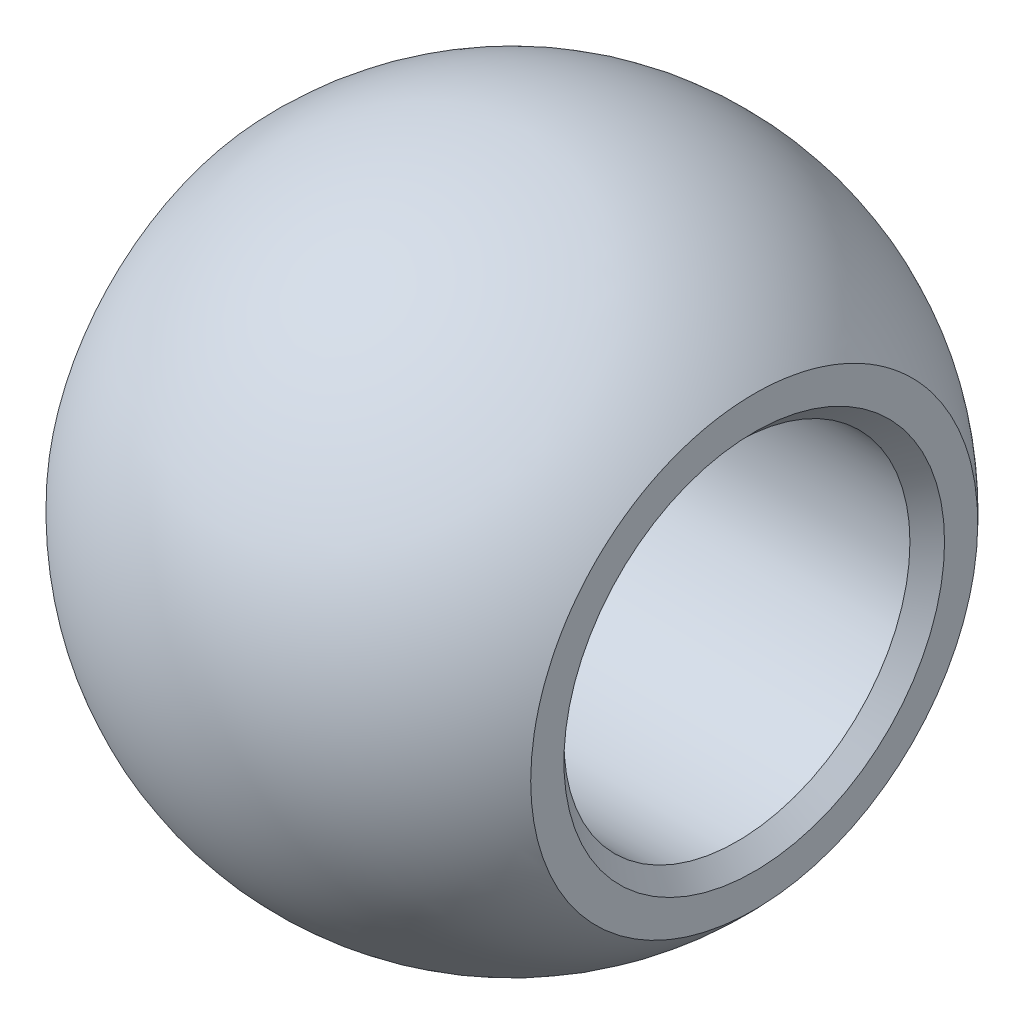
ISO-10303-21;
HEADER;
FILE_DESCRIPTION(('STEP AP214'),'2;1');
FILE_NAME('part.step','',(''),(''),'','','');
FILE_SCHEMA(('AUTOMOTIVE_DESIGN { 1 0 10303 214 1 1 1 1 }'));
ENDSEC;
DATA;
#1=APPLICATION_CONTEXT('core data for automotive mechanical design processes');
#2=APPLICATION_PROTOCOL_DEFINITION('international standard','automotive_design',2000,#1);
#3=PRODUCT_CONTEXT('',#1,'mechanical');
#4=PRODUCT('Part','Part','',(#3));
#5=PRODUCT_RELATED_PRODUCT_CATEGORY('part','',(#4));
#6=PRODUCT_DEFINITION_FORMATION('','',#4);
#7=PRODUCT_DEFINITION_CONTEXT('part definition',#1,'design');
#8=PRODUCT_DEFINITION('design','',#6,#7);
#9=PRODUCT_DEFINITION_SHAPE('','',#8);
#10=(LENGTH_UNIT() NAMED_UNIT(*) SI_UNIT(.MILLI.,.METRE.));
#11=(NAMED_UNIT(*) PLANE_ANGLE_UNIT() SI_UNIT($,.RADIAN.));
#12=(NAMED_UNIT(*) SI_UNIT($,.STERADIAN.) SOLID_ANGLE_UNIT());
#13=UNCERTAINTY_MEASURE_WITH_UNIT(LENGTH_MEASURE(1.E-05),#10,'distance_accuracy_value','');
#14=(GEOMETRIC_REPRESENTATION_CONTEXT(3) GLOBAL_UNCERTAINTY_ASSIGNED_CONTEXT((#13)) GLOBAL_UNIT_ASSIGNED_CONTEXT((#10,
#11,#12)) REPRESENTATION_CONTEXT('',''));
#15=CARTESIAN_POINT('',(0.,0.,0.));
#16=DIRECTION('',(0.,0.,1.));
#17=DIRECTION('',(1.,0.,0.));
#18=AXIS2_PLACEMENT_3D('',#15,#16,#17);
#19=CARTESIAN_POINT('',(0.,0.,0.));
#20=DIRECTION('',(1.,0.,0.));
#21=DIRECTION('',(0.,0.,-1.));
#22=AXIS2_PLACEMENT_3D('',#19,#20,#21);
#23=CYLINDRICAL_SURFACE('',#22,5.);
#24=CARTESIAN_POINT('',(-6.50000000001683,0.,0.));
#25=DIRECTION('',(-1.,0.,0.));
#26=DIRECTION('',(0.,1.,0.));
#27=AXIS2_PLACEMENT_3D('',#24,#25,#26);
#28=CIRCLE('',#27,4.99999999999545);
#29=CARTESIAN_POINT('',(-6.50000000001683,4.99999999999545,0.));
#30=VERTEX_POINT('',#29);
#31=EDGE_CURVE('E69',#30,#30,#28,.T.);
#32=ORIENTED_EDGE('',*,*,#31,.T.);
#33=EDGE_LOOP('',(#32));
#34=FACE_BOUND('',#33,.T.);
#35=CARTESIAN_POINT('',(6.50000000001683,0.,0.));
#36=DIRECTION('',(1.,0.,0.));
#37=DIRECTION('',(0.,1.,0.));
#38=AXIS2_PLACEMENT_3D('',#35,#36,#37);
#39=CIRCLE('',#38,4.99999999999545);
#40=CARTESIAN_POINT('',(6.50000000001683,4.99999999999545,0.));
#41=VERTEX_POINT('',#40);
#42=EDGE_CURVE('E34',#41,#41,#39,.T.);
#43=ORIENTED_EDGE('',*,*,#42,.T.);
#44=EDGE_LOOP('',(#43));
#45=FACE_BOUND('',#44,.T.);
#46=ADVANCED_FACE('F14',(#34,#45),#23,.F.);
#47=CARTESIAN_POINT('',(7.000000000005,0.,0.));
#48=DIRECTION('',(1.,0.,0.));
#49=DIRECTION('',(0.,0.,-1.));
#50=AXIS2_PLACEMENT_3D('',#47,#48,#49);
#51=CONICAL_SURFACE('',#50,5.50000000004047,0.785398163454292);
#52=CARTESIAN_POINT('',(7.000000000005,0.,0.));
#53=DIRECTION('',(1.,0.,0.));
#54=DIRECTION('',(0.,0.,-1.));
#55=AXIS2_PLACEMENT_3D('',#52,#53,#54);
#56=CIRCLE('',#55,5.50000000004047);
#57=CARTESIAN_POINT('',(7.000000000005,0.,-5.50000000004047));
#58=VERTEX_POINT('',#57);
#59=EDGE_CURVE('E20',#58,#58,#56,.F.);
#60=ORIENTED_EDGE('',*,*,#59,.F.);
#61=EDGE_LOOP('',(#60));
#62=FACE_BOUND('',#61,.T.);
#63=ORIENTED_EDGE('',*,*,#42,.F.);
#64=EDGE_LOOP('',(#63));
#65=FACE_BOUND('',#64,.T.);
#66=ADVANCED_FACE('F51',(#62,#65),#51,.F.);
#67=CARTESIAN_POINT('',(-7.000000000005,0.,0.));
#68=DIRECTION('',(-1.,0.,0.));
#69=DIRECTION('',(0.,0.,1.));
#70=AXIS2_PLACEMENT_3D('',#67,#68,#69);
#71=CONICAL_SURFACE('',#70,5.50000000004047,0.785398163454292);
#72=CARTESIAN_POINT('',(-7.000000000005,0.,0.));
#73=DIRECTION('',(-1.,0.,0.));
#74=DIRECTION('',(0.,0.,1.));
#75=AXIS2_PLACEMENT_3D('',#72,#73,#74);
#76=CIRCLE('',#75,5.50000000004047);
#77=CARTESIAN_POINT('',(-7.000000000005,0.,5.50000000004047));
#78=VERTEX_POINT('',#77);
#79=EDGE_CURVE('E29',#78,#78,#76,.F.);
#80=ORIENTED_EDGE('',*,*,#79,.F.);
#81=EDGE_LOOP('',(#80));
#82=FACE_BOUND('',#81,.T.);
#83=ORIENTED_EDGE('',*,*,#31,.F.);
#84=EDGE_LOOP('',(#83));
#85=FACE_BOUND('',#84,.T.);
#86=ADVANCED_FACE('F47',(#82,#85),#71,.F.);
#87=CARTESIAN_POINT('',(7.,0.,0.));
#88=DIRECTION('',(1.,0.,0.));
#89=DIRECTION('',(0.,0.,-1.));
#90=AXIS2_PLACEMENT_3D('',#87,#88,#89);
#91=PLANE('',#90);
#92=CARTESIAN_POINT('',(7.,0.,6.45953752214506));
#93=CARTESIAN_POINT('',(7.,0.181363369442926,6.45953652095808));
#94=CARTESIAN_POINT('',(7.,0.362759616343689,6.45189296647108));
#95=CARTESIAN_POINT('',(7.,0.724301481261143,6.42136606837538));
#96=CARTESIAN_POINT('',(7.,0.90444671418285,6.39847822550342));
#97=CARTESIAN_POINT('',(7.,1.26246120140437,6.33757336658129));
#98=CARTESIAN_POINT('',(7.,1.44032637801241,6.29953233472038));
#99=CARTESIAN_POINT('',(7.,1.79235879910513,6.20855491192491));
#100=CARTESIAN_POINT('',(7.,1.96652291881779,6.15560643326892));
#101=CARTESIAN_POINT('',(7.,2.30946766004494,6.035308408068));
#102=CARTESIAN_POINT('',(7.,2.47825703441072,5.9679838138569));
#103=CARTESIAN_POINT('',(7.,2.80964097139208,5.81932438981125));
#104=CARTESIAN_POINT('',(7.,2.97223269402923,5.73798322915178));
#105=CARTESIAN_POINT('',(7.,3.28999013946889,5.56188691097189));
#106=CARTESIAN_POINT('',(7.,3.44515558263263,5.46713124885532));
#107=CARTESIAN_POINT('',(7.,3.74688198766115,5.26492799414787));
#108=CARTESIAN_POINT('',(7.,3.89344680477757,5.15748615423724));
#109=CARTESIAN_POINT('',(7.,4.17709813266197,4.93056640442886));
#110=CARTESIAN_POINT('',(7.,4.31417845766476,4.81108076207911));
#111=CARTESIAN_POINT('',(7.,4.57765400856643,4.56110230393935));
#112=CARTESIAN_POINT('',(7.,4.70405940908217,4.43062021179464));
#113=CARTESIAN_POINT('',(7.,4.94548975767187,4.15941476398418));
#114=CARTESIAN_POINT('',(7.,5.06050952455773,4.01868679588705));
#115=CARTESIAN_POINT('',(7.,5.2783110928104,3.72800851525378));
#116=CARTESIAN_POINT('',(7.,5.38109005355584,3.57805607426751));
#117=CARTESIAN_POINT('',(7.,5.57361561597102,3.27007678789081));
#118=CARTESIAN_POINT('',(7.,5.66336660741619,3.1120526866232));
#119=CARTESIAN_POINT('',(7.,5.82927033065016,2.78894690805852));
#120=CARTESIAN_POINT('',(7.,5.90541803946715,2.6238626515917));
#121=CARTESIAN_POINT('',(7.,6.04350655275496,2.28792939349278));
#122=CARTESIAN_POINT('',(7.,6.10545277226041,2.1170826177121));
#123=CARTESIAN_POINT('',(7.,6.21475581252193,1.77071372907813));
#124=CARTESIAN_POINT('',(7.,6.26210716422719,1.59518989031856));
#125=CARTESIAN_POINT('',(7.,6.34183597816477,1.24084912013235));
#126=CARTESIAN_POINT('',(7.,6.37421954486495,1.06203356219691));
#127=CARTESIAN_POINT('',(7.,6.42382243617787,0.702228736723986));
#128=CARTESIAN_POINT('',(7.,6.44103488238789,0.521238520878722));
#129=CARTESIAN_POINT('',(7.,6.46014807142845,0.158451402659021));
#130=CARTESIAN_POINT('',(7.,6.462048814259,-0.0233454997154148));
#131=CARTESIAN_POINT('',(7.,6.4505277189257,-0.386370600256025));
#132=CARTESIAN_POINT('',(7.,6.43711282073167,-0.567599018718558));
#133=CARTESIAN_POINT('',(7.,6.39505843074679,-0.928355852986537));
#134=CARTESIAN_POINT('',(7.,6.36641272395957,-1.10788354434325));
#135=CARTESIAN_POINT('',(7.,6.29411016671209,-1.46382019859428));
#136=CARTESIAN_POINT('',(7.,6.25045893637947,-1.64023030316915));
#137=CARTESIAN_POINT('',(7.,6.14843371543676,-1.98881378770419));
#138=CARTESIAN_POINT('',(7.,6.09005410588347,-2.16098552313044));
#139=CARTESIAN_POINT('',(7.,5.95901978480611,-2.49973527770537));
#140=CARTESIAN_POINT('',(7.,5.88637033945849,-2.66631533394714));
#141=CARTESIAN_POINT('',(7.,5.72727210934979,-2.99281967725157));
#142=CARTESIAN_POINT('',(7.,5.64081867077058,-3.15274169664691));
#143=CARTESIAN_POINT('',(7.,5.45476642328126,-3.46469673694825));
#144=CARTESIAN_POINT('',(7.,5.35517066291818,-3.6167315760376));
#145=CARTESIAN_POINT('',(7.,5.14357429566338,-3.91180442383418));
#146=CARTESIAN_POINT('',(7.,5.03157932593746,-4.05484647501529));
#147=CARTESIAN_POINT('',(7.,4.79582932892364,-4.33112628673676));
#148=CARTESIAN_POINT('',(7.,4.67206305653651,-4.46435445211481));
#149=CARTESIAN_POINT('',(7.,4.41382603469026,-4.71982321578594));
#150=CARTESIAN_POINT('',(7.,4.27936224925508,-4.84207085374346));
#151=CARTESIAN_POINT('',(7.,4.00055307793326,-5.07485922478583));
#152=CARTESIAN_POINT('',(7.,3.85620325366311,-5.18539464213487));
#153=CARTESIAN_POINT('',(7.,3.55870855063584,-5.39390509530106));
#154=CARTESIAN_POINT('',(7.,3.40556400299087,-5.49188060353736));
#155=CARTESIAN_POINT('',(7.,3.09163525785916,-5.67453788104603));
#156=CARTESIAN_POINT('',(7.,2.93085454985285,-5.75922564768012));
#157=CARTESIAN_POINT('',(7.,2.60244887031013,-5.91489330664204));
#158=CARTESIAN_POINT('',(7.,2.4348125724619,-5.98584930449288));
#159=CARTESIAN_POINT('',(7.,2.09428860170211,-6.11331358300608));
#160=CARTESIAN_POINT('',(7.,1.92140530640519,-6.16983355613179));
#161=CARTESIAN_POINT('',(7.,1.57177245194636,-6.26802032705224));
#162=CARTESIAN_POINT('',(7.,1.395029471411,-6.30971057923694));
#163=CARTESIAN_POINT('',(7.,1.03869674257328,-6.37805820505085));
#164=CARTESIAN_POINT('',(7.,0.85910785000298,-6.40472001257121));
#165=CARTESIAN_POINT('',(7.,0.566033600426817,-6.43568843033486));
#166=CARTESIAN_POINT('',(7.,0.453017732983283,-6.44462904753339));
#167=CARTESIAN_POINT('',(7.,0.226672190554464,-6.45655390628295));
#168=CARTESIAN_POINT('',(7.,0.11334251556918,-6.45953814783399));
#169=CARTESIAN_POINT('',(7.,-0.181363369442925,-6.45953652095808));
#170=CARTESIAN_POINT('',(7.,-0.362759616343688,-6.45189296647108));
#171=CARTESIAN_POINT('',(7.,-0.724301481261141,-6.42136606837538));
#172=CARTESIAN_POINT('',(7.,-0.904446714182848,-6.39847822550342));
#173=CARTESIAN_POINT('',(7.,-1.26246120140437,-6.33757336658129));
#174=CARTESIAN_POINT('',(7.,-1.44032637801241,-6.29953233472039));
#175=CARTESIAN_POINT('',(7.,-1.79235879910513,-6.20855491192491));
#176=CARTESIAN_POINT('',(7.,-1.96652291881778,-6.15560643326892));
#177=CARTESIAN_POINT('',(7.,-2.30946766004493,-6.035308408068));
#178=CARTESIAN_POINT('',(7.,-2.47825703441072,-5.9679838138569));
#179=CARTESIAN_POINT('',(7.,-2.80964097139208,-5.81932438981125));
#180=CARTESIAN_POINT('',(7.,-2.97223269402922,-5.73798322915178));
#181=CARTESIAN_POINT('',(7.,-3.28999013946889,-5.56188691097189));
#182=CARTESIAN_POINT('',(7.,-3.44515558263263,-5.46713124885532));
#183=CARTESIAN_POINT('',(7.,-3.74688198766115,-5.26492799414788));
#184=CARTESIAN_POINT('',(7.,-3.89344680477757,-5.15748615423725));
#185=CARTESIAN_POINT('',(7.,-4.17709813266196,-4.93056640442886));
#186=CARTESIAN_POINT('',(7.,-4.31417845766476,-4.81108076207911));
#187=CARTESIAN_POINT('',(7.,-4.57765400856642,-4.56110230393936));
#188=CARTESIAN_POINT('',(7.,-4.70405940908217,-4.43062021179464));
#189=CARTESIAN_POINT('',(7.,-4.94548975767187,-4.15941476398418));
#190=CARTESIAN_POINT('',(7.,-5.06050952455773,-4.01868679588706));
#191=CARTESIAN_POINT('',(7.,-5.27831109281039,-3.72800851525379));
#192=CARTESIAN_POINT('',(7.,-5.38109005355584,-3.57805607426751));
#193=CARTESIAN_POINT('',(7.,-5.57361561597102,-3.27007678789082));
#194=CARTESIAN_POINT('',(7.,-5.66336660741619,-3.11205268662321));
#195=CARTESIAN_POINT('',(7.,-5.82927033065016,-2.78894690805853));
#196=CARTESIAN_POINT('',(7.,-5.90541803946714,-2.62386265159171));
#197=CARTESIAN_POINT('',(7.,-6.04350655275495,-2.28792939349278));
#198=CARTESIAN_POINT('',(7.,-6.10545277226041,-2.11708261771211));
#199=CARTESIAN_POINT('',(7.,-6.21475581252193,-1.77071372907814));
#200=CARTESIAN_POINT('',(6.99999999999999,-6.26210716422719,-1.59518989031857));
#201=CARTESIAN_POINT('',(6.99999999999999,-6.34183597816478,-1.24084912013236));
#202=CARTESIAN_POINT('',(7.,-6.37421954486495,-1.06203356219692));
#203=CARTESIAN_POINT('',(7.,-6.42382243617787,-0.702228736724));
#204=CARTESIAN_POINT('',(7.,-6.44103488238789,-0.521238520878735));
#205=CARTESIAN_POINT('',(7.,-6.46014807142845,-0.158451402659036));
#206=CARTESIAN_POINT('',(7.,-6.462048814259,0.0233454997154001));
#207=CARTESIAN_POINT('',(7.,-6.4505277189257,0.386370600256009));
#208=CARTESIAN_POINT('',(7.,-6.43711282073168,0.567599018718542));
#209=CARTESIAN_POINT('',(7.,-6.3950584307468,0.928355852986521));
#210=CARTESIAN_POINT('',(7.,-6.36641272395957,1.10788354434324));
#211=CARTESIAN_POINT('',(7.,-6.29411016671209,1.46382019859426));
#212=CARTESIAN_POINT('',(7.,-6.25045893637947,1.64023030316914));
#213=CARTESIAN_POINT('',(7.,-6.14843371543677,1.98881378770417));
#214=CARTESIAN_POINT('',(7.,-6.09005410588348,2.16098552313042));
#215=CARTESIAN_POINT('',(7.,-5.95901978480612,2.49973527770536));
#216=CARTESIAN_POINT('',(6.99999999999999,-5.8863703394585,2.66631533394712));
#217=CARTESIAN_POINT('',(6.99999999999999,-5.7272721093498,2.99281967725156));
#218=CARTESIAN_POINT('',(7.,-5.64081867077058,3.1527416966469));
#219=CARTESIAN_POINT('',(7.,-5.45476642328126,3.46469673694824));
#220=CARTESIAN_POINT('',(7.,-5.35517066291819,3.61673157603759));
#221=CARTESIAN_POINT('',(7.,-5.14357429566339,3.91180442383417));
#222=CARTESIAN_POINT('',(7.,-5.03157932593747,4.05484647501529));
#223=CARTESIAN_POINT('',(7.,-4.79582932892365,4.33112628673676));
#224=CARTESIAN_POINT('',(7.,-4.67206305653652,4.46435445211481));
#225=CARTESIAN_POINT('',(7.,-4.41382603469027,4.71982321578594));
#226=CARTESIAN_POINT('',(7.,-4.2793622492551,4.84207085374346));
#227=CARTESIAN_POINT('',(7.,-4.00055307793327,5.07485922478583));
#228=CARTESIAN_POINT('',(7.,-3.85620325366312,5.18539464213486));
#229=CARTESIAN_POINT('',(7.,-3.55870855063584,5.39390509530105));
#230=CARTESIAN_POINT('',(7.,-3.40556400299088,5.49188060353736));
#231=CARTESIAN_POINT('',(7.,-3.09163525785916,5.67453788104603));
#232=CARTESIAN_POINT('',(7.,-2.93085454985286,5.75922564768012));
#233=CARTESIAN_POINT('',(7.,-2.60244887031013,5.91489330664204));
#234=CARTESIAN_POINT('',(7.,-2.43481257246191,5.98584930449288));
#235=CARTESIAN_POINT('',(7.,-2.09428860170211,6.11331358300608));
#236=CARTESIAN_POINT('',(7.,-1.92140530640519,6.16983355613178));
#237=CARTESIAN_POINT('',(7.,-1.57177245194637,6.26802032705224));
#238=CARTESIAN_POINT('',(7.,-1.39502947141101,6.30971057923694));
#239=CARTESIAN_POINT('',(7.,-1.03869674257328,6.37805820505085));
#240=CARTESIAN_POINT('',(7.,-0.859107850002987,6.40472001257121));
#241=CARTESIAN_POINT('',(7.,-0.566033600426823,6.43568843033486));
#242=CARTESIAN_POINT('',(7.,-0.453017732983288,6.44462904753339));
#243=CARTESIAN_POINT('',(7.,-0.226672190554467,6.45655390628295));
#244=CARTESIAN_POINT('',(7.,-0.113342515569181,6.45953814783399));
#245=CARTESIAN_POINT('',(7.,0.,6.45953752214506));
#246=B_SPLINE_CURVE_WITH_KNOTS('',3,(#92,#93,#94,#95,#96,#97,#98,#99,#100,#101,#102,#103,#104,
#105,#106,#107,#108,#109,#110,#111,#112,#113,#114,#115,#116,#117,#118,#119,#120,#121,#122,#123,
#124,#125,#126,#127,#128,#129,#130,#131,#132,#133,#134,#135,#136,#137,#138,#139,#140,#141,#142,
#143,#144,#145,#146,#147,#148,#149,#150,#151,#152,#153,#154,#155,#156,#157,#158,#159,#160,#161,
#162,#163,#164,#165,#166,#167,#168,#169,#170,#171,#172,#173,#174,#175,#176,#177,#178,#179,#180,
#181,#182,#183,#184,#185,#186,#187,#188,#189,#190,#191,#192,#193,#194,#195,#196,#197,#198,#199,
#200,#201,#202,#203,#204,#205,#206,#207,#208,#209,#210,#211,#212,#213,#214,#215,#216,#217,#218,
#219,#220,#221,#222,#223,#224,#225,#226,#227,#228,#229,#230,#231,#232,#233,#234,#235,#236,#237,
#238,#239,#240,#241,#242,#243,#244,#245),.UNSPECIFIED.,.T.,.F.,(4,2,2,2,2,2,2,2,2,2,2,2,2,2,2,2,
2,2,2,2,2,2,2,2,2,2,2,2,2,2,2,2,2,2,2,2,2,2,2,2,2,2,2,2,2,2,2,2,2,2,2,2,2,2,2,2,2,2,2,2,2,2,2,2,
2,2,2,2,2,2,2,2,2,2,2,2,4),(0.,0.54398632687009,1.08813327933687,1.63314608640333,
2.17860209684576,2.72311895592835,3.26788240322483,3.81266634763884,4.35720419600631,
4.90209390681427,5.44645826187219,5.99106920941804,6.53580629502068,7.08035940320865,
7.62511317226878,8.16965887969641,8.71440839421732,9.25893554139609,9.80370944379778,
10.3484833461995,10.8930104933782,11.4377600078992,11.9823057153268,12.5270594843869,
13.0716125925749,13.6163496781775,14.1609606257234,14.7053249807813,15.2502146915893,
15.7947525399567,16.3395364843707,16.8842999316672,17.4288167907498,17.9742728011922,
18.5192856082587,19.0634325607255,19.6074188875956,19.9473815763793,20.287344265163,
20.8313305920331,21.3754775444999,21.9204903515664,22.4659463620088,23.0104632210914,
23.5552266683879,24.1000106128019,24.6445484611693,25.1894381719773,25.7338025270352,
26.2784134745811,26.8231505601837,27.3677036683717,27.9124574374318,28.4570031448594,
29.0017526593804,29.5462798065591,30.0910537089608,30.6358276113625,31.1803547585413,
31.7251042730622,32.2696499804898,32.8144037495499,33.3589568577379,33.9036939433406,
34.4483048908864,34.9926692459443,35.5375589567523,36.0820968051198,36.6268807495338,
37.1716441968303,37.7161610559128,38.2616170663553,38.8066298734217,39.3507768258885,
39.8947631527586,40.2347258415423,40.5746885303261),.UNSPECIFIED.);
#247=CARTESIAN_POINT('',(7.,0.,6.45953752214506));
#248=VERTEX_POINT('',#247);
#249=EDGE_CURVE('E24',#248,#248,#246,.T.);
#250=ORIENTED_EDGE('',*,*,#249,.F.);
#251=EDGE_LOOP('',(#250));
#252=FACE_BOUND('',#251,.T.);
#253=ORIENTED_EDGE('',*,*,#59,.T.);
#254=EDGE_LOOP('',(#253));
#255=FACE_BOUND('',#254,.T.);
#256=ADVANCED_FACE('F42',(#252,#255),#91,.T.);
#257=CARTESIAN_POINT('',(-7.,0.,0.));
#258=DIRECTION('',(-1.,0.,0.));
#259=DIRECTION('',(0.,0.,1.));
#260=AXIS2_PLACEMENT_3D('',#257,#258,#259);
#261=PLANE('',#260);
#262=CARTESIAN_POINT('',(-7.,0.,-6.45953752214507));
#263=CARTESIAN_POINT('',(-7.,0.181363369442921,-6.45953652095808));
#264=CARTESIAN_POINT('',(-7.,0.362759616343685,-6.45189296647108));
#265=CARTESIAN_POINT('',(-7.,0.724301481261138,-6.42136606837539));
#266=CARTESIAN_POINT('',(-7.,0.904446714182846,-6.39847822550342));
#267=CARTESIAN_POINT('',(-7.,1.26246120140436,-6.33757336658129));
#268=CARTESIAN_POINT('',(-7.,1.4403263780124,-6.29953233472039));
#269=CARTESIAN_POINT('',(-7.,1.79235879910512,-6.20855491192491));
#270=CARTESIAN_POINT('',(-7.,1.96652291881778,-6.15560643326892));
#271=CARTESIAN_POINT('',(-7.,2.30946766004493,-6.035308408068));
#272=CARTESIAN_POINT('',(-7.,2.47825703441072,-5.96798381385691));
#273=CARTESIAN_POINT('',(-7.,2.80964097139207,-5.81932438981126));
#274=CARTESIAN_POINT('',(-7.,2.97223269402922,-5.73798322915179));
#275=CARTESIAN_POINT('',(-7.,3.28999013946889,-5.5618869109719));
#276=CARTESIAN_POINT('',(-7.,3.44515558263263,-5.46713124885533));
#277=CARTESIAN_POINT('',(-7.,3.74688198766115,-5.26492799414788));
#278=CARTESIAN_POINT('',(-7.,3.89344680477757,-5.15748615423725));
#279=CARTESIAN_POINT('',(-7.,4.17709813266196,-4.93056640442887));
#280=CARTESIAN_POINT('',(-7.,4.31417845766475,-4.81108076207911));
#281=CARTESIAN_POINT('',(-7.,4.57765400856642,-4.56110230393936));
#282=CARTESIAN_POINT('',(-7.,4.70405940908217,-4.43062021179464));
#283=CARTESIAN_POINT('',(-7.,4.94548975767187,-4.15941476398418));
#284=CARTESIAN_POINT('',(-7.,5.06050952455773,-4.01868679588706));
#285=CARTESIAN_POINT('',(-7.,5.2783110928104,-3.72800851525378));
#286=CARTESIAN_POINT('',(-7.,5.38109005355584,-3.57805607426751));
#287=CARTESIAN_POINT('',(-7.,5.57361561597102,-3.27007678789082));
#288=CARTESIAN_POINT('',(-7.,5.66336660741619,-3.11205268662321));
#289=CARTESIAN_POINT('',(-7.,5.82927033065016,-2.78894690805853));
#290=CARTESIAN_POINT('',(-7.,5.90541803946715,-2.6238626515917));
#291=CARTESIAN_POINT('',(-7.,6.04350655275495,-2.28792939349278));
#292=CARTESIAN_POINT('',(-7.,6.10545277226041,-2.1170826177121));
#293=CARTESIAN_POINT('',(-7.,6.21475581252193,-1.77071372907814));
#294=CARTESIAN_POINT('',(-7.,6.26210716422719,-1.59518989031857));
#295=CARTESIAN_POINT('',(-7.,6.34183597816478,-1.24084912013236));
#296=CARTESIAN_POINT('',(-7.,6.37421954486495,-1.06203356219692));
#297=CARTESIAN_POINT('',(-7.,6.42382243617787,-0.702228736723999));
#298=CARTESIAN_POINT('',(-7.,6.44103488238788,-0.521238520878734));
#299=CARTESIAN_POINT('',(-7.,6.46014807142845,-0.158451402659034));
#300=CARTESIAN_POINT('',(-7.,6.462048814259,0.0233454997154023));
#301=CARTESIAN_POINT('',(-7.,6.4505277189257,0.386370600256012));
#302=CARTESIAN_POINT('',(-7.,6.43711282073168,0.567599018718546));
#303=CARTESIAN_POINT('',(-7.,6.3950584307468,0.928355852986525));
#304=CARTESIAN_POINT('',(-7.,6.36641272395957,1.10788354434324));
#305=CARTESIAN_POINT('',(-7.,6.29411016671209,1.46382019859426));
#306=CARTESIAN_POINT('',(-7.,6.25045893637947,1.64023030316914));
#307=CARTESIAN_POINT('',(-7.,6.14843371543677,1.98881378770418));
#308=CARTESIAN_POINT('',(-7.,6.09005410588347,2.16098552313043));
#309=CARTESIAN_POINT('',(-7.,5.95901978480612,2.49973527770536));
#310=CARTESIAN_POINT('',(-7.,5.8863703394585,2.66631533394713));
#311=CARTESIAN_POINT('',(-7.,5.7272721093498,2.99281967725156));
#312=CARTESIAN_POINT('',(-7.,5.64081867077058,3.1527416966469));
#313=CARTESIAN_POINT('',(-7.,5.45476642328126,3.46469673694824));
#314=CARTESIAN_POINT('',(-7.,5.35517066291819,3.61673157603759));
#315=CARTESIAN_POINT('',(-7.,5.14357429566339,3.91180442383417));
#316=CARTESIAN_POINT('',(-7.,5.03157932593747,4.05484647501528));
#317=CARTESIAN_POINT('',(-7.,4.79582932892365,4.33112628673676));
#318=CARTESIAN_POINT('',(-7.,4.67206305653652,4.46435445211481));
#319=CARTESIAN_POINT('',(-7.,4.41382603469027,4.71982321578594));
#320=CARTESIAN_POINT('',(-7.,4.27936224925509,4.84207085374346));
#321=CARTESIAN_POINT('',(-7.,4.00055307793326,5.07485922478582));
#322=CARTESIAN_POINT('',(-7.,3.85620325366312,5.18539464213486));
#323=CARTESIAN_POINT('',(-7.,3.55870855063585,5.39390509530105));
#324=CARTESIAN_POINT('',(-7.,3.40556400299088,5.49188060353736));
#325=CARTESIAN_POINT('',(-7.,3.09163525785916,5.67453788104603));
#326=CARTESIAN_POINT('',(-7.,2.93085454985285,5.75922564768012));
#327=CARTESIAN_POINT('',(-7.,2.60244887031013,5.91489330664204));
#328=CARTESIAN_POINT('',(-7.,2.43481257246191,5.98584930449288));
#329=CARTESIAN_POINT('',(-7.,2.09428860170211,6.11331358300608));
#330=CARTESIAN_POINT('',(-7.,1.92140530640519,6.16983355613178));
#331=CARTESIAN_POINT('',(-7.,1.57177245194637,6.26802032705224));
#332=CARTESIAN_POINT('',(-7.,1.395029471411,6.30971057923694));
#333=CARTESIAN_POINT('',(-7.,1.03869674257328,6.37805820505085));
#334=CARTESIAN_POINT('',(-7.,0.859107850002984,6.40472001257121));
#335=CARTESIAN_POINT('',(-7.,0.566033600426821,6.43568843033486));
#336=CARTESIAN_POINT('',(-7.,0.453017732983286,6.44462904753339));
#337=CARTESIAN_POINT('',(-7.,0.226672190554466,6.45655390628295));
#338=CARTESIAN_POINT('',(-7.,0.113342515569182,6.45953814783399));
#339=CARTESIAN_POINT('',(-7.,-0.181363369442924,6.45953652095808));
#340=CARTESIAN_POINT('',(-7.,-0.362759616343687,6.45189296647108));
#341=CARTESIAN_POINT('',(-7.,-0.72430148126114,6.42136606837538));
#342=CARTESIAN_POINT('',(-7.,-0.904446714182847,6.39847822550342));
#343=CARTESIAN_POINT('',(-7.,-1.26246120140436,6.33757336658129));
#344=CARTESIAN_POINT('',(-7.,-1.44032637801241,6.29953233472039));
#345=CARTESIAN_POINT('',(-7.,-1.79235879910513,6.20855491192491));
#346=CARTESIAN_POINT('',(-7.,-1.96652291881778,6.15560643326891));
#347=CARTESIAN_POINT('',(-7.,-2.30946766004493,6.035308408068));
#348=CARTESIAN_POINT('',(-7.,-2.47825703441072,5.96798381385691));
#349=CARTESIAN_POINT('',(-7.,-2.80964097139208,5.81932438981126));
#350=CARTESIAN_POINT('',(-7.,-2.97223269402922,5.73798322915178));
#351=CARTESIAN_POINT('',(-7.,-3.28999013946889,5.56188691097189));
#352=CARTESIAN_POINT('',(-7.,-3.44515558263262,5.46713124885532));
#353=CARTESIAN_POINT('',(-7.,-3.74688198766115,5.26492799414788));
#354=CARTESIAN_POINT('',(-7.,-3.89344680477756,5.15748615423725));
#355=CARTESIAN_POINT('',(-7.,-4.17709813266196,4.93056640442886));
#356=CARTESIAN_POINT('',(-7.,-4.31417845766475,4.81108076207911));
#357=CARTESIAN_POINT('',(-7.,-4.57765400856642,4.56110230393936));
#358=CARTESIAN_POINT('',(-7.,-4.70405940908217,4.43062021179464));
#359=CARTESIAN_POINT('',(-7.,-4.94548975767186,4.15941476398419));
#360=CARTESIAN_POINT('',(-7.,-5.06050952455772,4.01868679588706));
#361=CARTESIAN_POINT('',(-7.,-5.27831109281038,3.72800851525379));
#362=CARTESIAN_POINT('',(-7.,-5.38109005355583,3.57805607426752));
#363=CARTESIAN_POINT('',(-7.,-5.57361561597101,3.27007678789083));
#364=CARTESIAN_POINT('',(-7.,-5.66336660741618,3.11205268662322));
#365=CARTESIAN_POINT('',(-7.,-5.82927033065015,2.78894690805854));
#366=CARTESIAN_POINT('',(-7.,-5.90541803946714,2.62386265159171));
#367=CARTESIAN_POINT('',(-7.,-6.04350655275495,2.28792939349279));
#368=CARTESIAN_POINT('',(-7.,-6.1054527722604,2.11708261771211));
#369=CARTESIAN_POINT('',(-7.,-6.21475581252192,1.77071372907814));
#370=CARTESIAN_POINT('',(-7.,-6.26210716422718,1.59518989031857));
#371=CARTESIAN_POINT('',(-7.,-6.34183597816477,1.24084912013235));
#372=CARTESIAN_POINT('',(-7.,-6.37421954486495,1.06203356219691));
#373=CARTESIAN_POINT('',(-7.,-6.42382243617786,0.702228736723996));
#374=CARTESIAN_POINT('',(-7.,-6.44103488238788,0.521238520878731));
#375=CARTESIAN_POINT('',(-7.,-6.46014807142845,0.15845140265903));
#376=CARTESIAN_POINT('',(-7.,-6.462048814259,-0.0233454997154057));
#377=CARTESIAN_POINT('',(-7.,-6.4505277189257,-0.386370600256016));
#378=CARTESIAN_POINT('',(-7.,-6.43711282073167,-0.567599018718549));
#379=CARTESIAN_POINT('',(-7.,-6.39505843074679,-0.928355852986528));
#380=CARTESIAN_POINT('',(-7.,-6.36641272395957,-1.10788354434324));
#381=CARTESIAN_POINT('',(-7.,-6.29411016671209,-1.46382019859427));
#382=CARTESIAN_POINT('',(-7.,-6.25045893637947,-1.64023030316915));
#383=CARTESIAN_POINT('',(-7.,-6.14843371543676,-1.98881378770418));
#384=CARTESIAN_POINT('',(-7.,-6.09005410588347,-2.16098552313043));
#385=CARTESIAN_POINT('',(-7.,-5.95901978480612,-2.49973527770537));
#386=CARTESIAN_POINT('',(-7.,-5.8863703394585,-2.66631533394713));
#387=CARTESIAN_POINT('',(-7.,-5.7272721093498,-2.99281967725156));
#388=CARTESIAN_POINT('',(-7.,-5.64081867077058,-3.15274169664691));
#389=CARTESIAN_POINT('',(-7.,-5.45476642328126,-3.46469673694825));
#390=CARTESIAN_POINT('',(-7.,-5.35517066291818,-3.6167315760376));
#391=CARTESIAN_POINT('',(-7.,-5.14357429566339,-3.91180442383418));
#392=CARTESIAN_POINT('',(-7.,-5.03157932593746,-4.05484647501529));
#393=CARTESIAN_POINT('',(-7.,-4.79582932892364,-4.33112628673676));
#394=CARTESIAN_POINT('',(-7.,-4.67206305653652,-4.46435445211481));
#395=CARTESIAN_POINT('',(-7.,-4.41382603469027,-4.71982321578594));
#396=CARTESIAN_POINT('',(-7.,-4.27936224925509,-4.84207085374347));
#397=CARTESIAN_POINT('',(-7.,-4.00055307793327,-5.07485922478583));
#398=CARTESIAN_POINT('',(-7.,-3.85620325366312,-5.18539464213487));
#399=CARTESIAN_POINT('',(-7.,-3.55870855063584,-5.39390509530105));
#400=CARTESIAN_POINT('',(-7.,-3.40556400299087,-5.49188060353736));
#401=CARTESIAN_POINT('',(-7.,-3.09163525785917,-5.67453788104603));
#402=CARTESIAN_POINT('',(-6.99999999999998,-2.93085454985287,-5.75922564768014));
#403=CARTESIAN_POINT('',(-6.99999999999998,-2.60244887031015,-5.91489330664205));
#404=CARTESIAN_POINT('',(-7.,-2.43481257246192,-5.98584930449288));
#405=CARTESIAN_POINT('',(-7.,-2.09428860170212,-6.11331358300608));
#406=CARTESIAN_POINT('',(-7.,-1.9214053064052,-6.16983355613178));
#407=CARTESIAN_POINT('',(-7.,-1.57177245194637,-6.26802032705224));
#408=CARTESIAN_POINT('',(-7.,-1.39502947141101,-6.30971057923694));
#409=CARTESIAN_POINT('',(-7.,-1.03869674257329,-6.37805820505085));
#410=CARTESIAN_POINT('',(-7.,-0.85910785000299,-6.40472001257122));
#411=CARTESIAN_POINT('',(-7.,-0.566033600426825,-6.43568843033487));
#412=CARTESIAN_POINT('',(-7.,-0.45301773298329,-6.44462904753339));
#413=CARTESIAN_POINT('',(-7.,-0.22667219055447,-6.45655390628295));
#414=CARTESIAN_POINT('',(-7.,-0.113342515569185,-6.45953814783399));
#415=CARTESIAN_POINT('',(-7.,0.,-6.45953752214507));
#416=B_SPLINE_CURVE_WITH_KNOTS('',3,(#262,#263,#264,#265,#266,#267,#268,#269,#270,#271,#272,
#273,#274,#275,#276,#277,#278,#279,#280,#281,#282,#283,#284,#285,#286,#287,#288,#289,#290,#291,
#292,#293,#294,#295,#296,#297,#298,#299,#300,#301,#302,#303,#304,#305,#306,#307,#308,#309,#310,
#311,#312,#313,#314,#315,#316,#317,#318,#319,#320,#321,#322,#323,#324,#325,#326,#327,#328,#329,
#330,#331,#332,#333,#334,#335,#336,#337,#338,#339,#340,#341,#342,#343,#344,#345,#346,#347,#348,
#349,#350,#351,#352,#353,#354,#355,#356,#357,#358,#359,#360,#361,#362,#363,#364,#365,#366,#367,
#368,#369,#370,#371,#372,#373,#374,#375,#376,#377,#378,#379,#380,#381,#382,#383,#384,#385,#386,
#387,#388,#389,#390,#391,#392,#393,#394,#395,#396,#397,#398,#399,#400,#401,#402,#403,#404,#405,
#406,#407,#408,#409,#410,#411,#412,#413,#414,#415),.UNSPECIFIED.,.T.,.F.,(4,2,2,2,2,2,2,2,2,2,2,
2,2,2,2,2,2,2,2,2,2,2,2,2,2,2,2,2,2,2,2,2,2,2,2,2,2,2,2,2,2,2,2,2,2,2,2,2,2,2,2,2,2,2,2,2,2,2,2,
2,2,2,2,2,2,2,2,2,2,2,2,2,2,2,2,2,4),(0.,0.54398632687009,1.08813327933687,1.63314608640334,
2.17860209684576,2.72311895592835,3.26788240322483,3.81266634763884,4.3572041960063,
4.90209390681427,5.44645826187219,5.99106920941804,6.53580629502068,7.08035940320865,
7.62511317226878,8.16965887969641,8.71440839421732,9.25893554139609,9.80370944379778,
10.3484833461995,10.8930104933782,11.4377600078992,11.9823057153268,12.5270594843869,
13.0716125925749,13.6163496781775,14.1609606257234,14.7053249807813,15.2502146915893,
15.7947525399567,16.3395364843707,16.8842999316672,17.4288167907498,17.9742728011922,
18.5192856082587,19.0634325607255,19.6074188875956,19.9473815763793,20.287344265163,
20.8313305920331,21.3754775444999,21.9204903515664,22.4659463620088,23.0104632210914,
23.5552266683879,24.1000106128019,24.6445484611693,25.1894381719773,25.7338025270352,
26.2784134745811,26.8231505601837,27.3677036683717,27.9124574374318,28.4570031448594,
29.0017526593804,29.5462798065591,30.0910537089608,30.6358276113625,31.1803547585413,
31.7251042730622,32.2696499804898,32.81440374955,33.3589568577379,33.9036939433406,
34.4483048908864,34.9926692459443,35.5375589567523,36.0820968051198,36.6268807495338,
37.1716441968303,37.7161610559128,38.2616170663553,38.8066298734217,39.3507768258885,
39.8947631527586,40.2347258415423,40.5746885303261),.UNSPECIFIED.);
#417=CARTESIAN_POINT('',(-7.,0.,-6.45953752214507));
#418=VERTEX_POINT('',#417);
#419=EDGE_CURVE('E9',#418,#418,#416,.T.);
#420=ORIENTED_EDGE('',*,*,#419,.F.);
#421=EDGE_LOOP('',(#420));
#422=FACE_BOUND('',#421,.T.);
#423=ORIENTED_EDGE('',*,*,#79,.T.);
#424=EDGE_LOOP('',(#423));
#425=FACE_BOUND('',#424,.T.);
#426=ADVANCED_FACE('F39',(#422,#425),#261,.T.);
#427=CARTESIAN_POINT('',(0.,0.,0.));
#428=DIRECTION('',(0.86323417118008,0.50454675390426,0.0161040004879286));
#429=DIRECTION('',(-0.468993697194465,0.813390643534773,-0.344151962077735));
#430=AXIS2_PLACEMENT_3D('',#427,#428,#429);
#431=SPHERICAL_SURFACE('',#430,9.525);
#432=ORIENTED_EDGE('',*,*,#249,.T.);
#433=EDGE_LOOP('',(#432));
#434=FACE_BOUND('',#433,.T.);
#435=ORIENTED_EDGE('',*,*,#419,.T.);
#436=EDGE_LOOP('',(#435));
#437=FACE_BOUND('',#436,.T.);
#438=ADVANCED_FACE('F16',(#434,#437),#431,.T.);
#439=CLOSED_SHELL('',(#46,#66,#86,#256,#426,#438));
#440=MANIFOLD_SOLID_BREP('B1',#439);
#441=ADVANCED_BREP_SHAPE_REPRESENTATION('',(#18,#440),#14);
#442=SHAPE_DEFINITION_REPRESENTATION(#9,#441);
ENDSEC;
END-ISO-10303-21;
